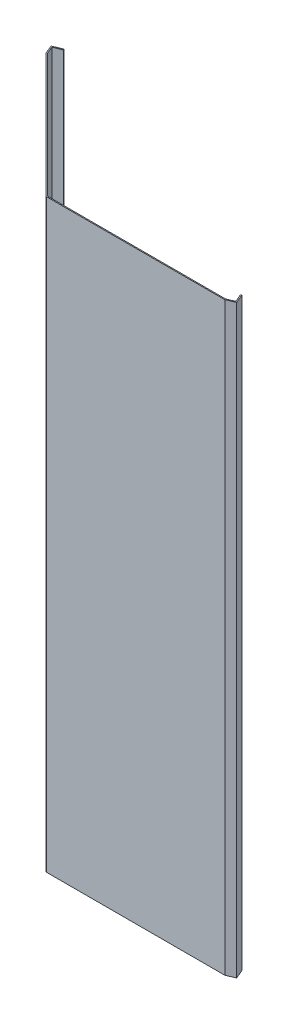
ISO-10303-21;
HEADER;
FILE_DESCRIPTION(('STEP AP214'),'2;1');
FILE_NAME('part.step','',(''),(''),'','','');
FILE_SCHEMA(('AUTOMOTIVE_DESIGN { 1 0 10303 214 1 1 1 1 }'));
ENDSEC;
DATA;
#1=APPLICATION_CONTEXT('core data for automotive mechanical design processes');
#2=APPLICATION_PROTOCOL_DEFINITION('international standard','automotive_design',2000,#1);
#3=PRODUCT_CONTEXT('',#1,'mechanical');
#4=PRODUCT('Part','Part','',(#3));
#5=PRODUCT_RELATED_PRODUCT_CATEGORY('part','',(#4));
#6=PRODUCT_DEFINITION_FORMATION('','',#4);
#7=PRODUCT_DEFINITION_CONTEXT('part definition',#1,'design');
#8=PRODUCT_DEFINITION('design','',#6,#7);
#9=PRODUCT_DEFINITION_SHAPE('','',#8);
#10=(LENGTH_UNIT() NAMED_UNIT(*) SI_UNIT(.MILLI.,.METRE.));
#11=(NAMED_UNIT(*) PLANE_ANGLE_UNIT() SI_UNIT($,.RADIAN.));
#12=(NAMED_UNIT(*) SI_UNIT($,.STERADIAN.) SOLID_ANGLE_UNIT());
#13=UNCERTAINTY_MEASURE_WITH_UNIT(LENGTH_MEASURE(1.E-05),#10,'distance_accuracy_value','');
#14=(GEOMETRIC_REPRESENTATION_CONTEXT(3) GLOBAL_UNCERTAINTY_ASSIGNED_CONTEXT((#13)) GLOBAL_UNIT_ASSIGNED_CONTEXT((#10,
#11,#12)) REPRESENTATION_CONTEXT('',''));
#15=CARTESIAN_POINT('',(0.,0.,0.));
#16=DIRECTION('',(0.,0.,1.));
#17=DIRECTION('',(1.,0.,0.));
#18=AXIS2_PLACEMENT_3D('',#15,#16,#17);
#19=CARTESIAN_POINT('',(-1155.74796303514,0.,-527.345895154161));
#20=DIRECTION('',(0.,-1.,0.));
#21=DIRECTION('',(-1.,0.,0.));
#22=AXIS2_PLACEMENT_3D('',#19,#20,#21);
#23=PLANE('',#22);
#24=DIRECTION('',(0.707106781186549,0.,-0.707106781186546));
#25=VECTOR('',#24,1.);
#26=CARTESIAN_POINT('',(-1022.47940818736,0.,-394.077340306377));
#27=LINE('',#26,#25);
#28=CARTESIAN_POINT('',(-1055.77837424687,0.,-360.778374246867));
#29=VERTEX_POINT('',#28);
#30=CARTESIAN_POINT('',(-1052.94994712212,0.,-363.606801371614));
#31=VERTEX_POINT('',#30);
#32=EDGE_CURVE('E554',#29,#31,#27,.T.);
#33=ORIENTED_EDGE('',*,*,#32,.F.);
#34=DIRECTION('',(-0.707106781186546,0.,-0.707106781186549));
#35=VECTOR('',#34,1.);
#36=CARTESIAN_POINT('',(-695.,0.,0.));
#37=LINE('',#36,#35);
#38=CARTESIAN_POINT('',(-1179.36814511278,0.,-484.368145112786));
#39=VERTEX_POINT('',#38);
#40=EDGE_CURVE('E466',#29,#39,#37,.T.);
#41=ORIENTED_EDGE('',*,*,#40,.T.);
#42=DIRECTION('',(-0.37460659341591,0.,-0.927183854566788));
#43=VECTOR('',#42,1.);
#44=CARTESIAN_POINT('',(-1179.36814511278,0.,-484.368145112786));
#45=LINE('',#44,#43);
#46=CARTESIAN_POINT('',(-1192.47937588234,0.,-516.819580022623));
#47=VERTEX_POINT('',#46);
#48=EDGE_CURVE('E463',#39,#47,#45,.T.);
#49=ORIENTED_EDGE('',*,*,#48,.T.);
#50=DIRECTION('',(0.927183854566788,0.,-0.37460659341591));
#51=VECTOR('',#50,1.);
#52=CARTESIAN_POINT('',(-1192.47937588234,0.,-516.819580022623));
#53=LINE('',#52,#51);
#54=CARTESIAN_POINT('',(-1157.2463894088,0.,-531.054630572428));
#55=VERTEX_POINT('',#54);
#56=EDGE_CURVE('E460',#47,#55,#53,.T.);
#57=ORIENTED_EDGE('',*,*,#56,.T.);
#58=DIRECTION('',(0.374606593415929,0.,0.927183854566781));
#59=VECTOR('',#58,1.);
#60=CARTESIAN_POINT('',(-1157.2463894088,0.,-531.054630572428));
#61=LINE('',#60,#59);
#62=CARTESIAN_POINT('',(-1155.74796303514,0.,-527.345895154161));
#63=VERTEX_POINT('',#62);
#64=EDGE_CURVE('E457',#55,#63,#61,.T.);
#65=ORIENTED_EDGE('',*,*,#64,.T.);
#66=DIRECTION('',(0.927183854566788,0.,-0.37460659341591));
#67=VECTOR('',#66,1.);
#68=CARTESIAN_POINT('',(-1190.98094950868,0.,-513.110844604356));
#69=LINE('',#68,#67);
#70=CARTESIAN_POINT('',(-1187.27221409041,0.,-514.60927097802));
#71=VERTEX_POINT('',#70);
#72=EDGE_CURVE('E410',#71,#63,#69,.T.);
#73=ORIENTED_EDGE('',*,*,#72,.F.);
#74=DIRECTION('',(-0.37460659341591,0.,-0.927183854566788));
#75=VECTOR('',#74,1.);
#76=CARTESIAN_POINT('',(-1175.65940969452,0.,-485.866571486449));
#77=LINE('',#76,#75);
#78=CARTESIAN_POINT('',(-1175.96426798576,0.,-486.62112223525));
#79=VERTEX_POINT('',#78);
#80=EDGE_CURVE('E420',#79,#71,#77,.T.);
#81=ORIENTED_EDGE('',*,*,#80,.F.);
#82=DIRECTION('',(-0.707106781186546,0.,-0.707106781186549));
#83=VECTOR('',#82,1.);
#84=CARTESIAN_POINT('',(-692.171572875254,0.,-2.8284271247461));
#85=LINE('',#84,#83);
#86=EDGE_CURVE('E489',#31,#79,#85,.T.);
#87=ORIENTED_EDGE('',*,*,#86,.F.);
#88=EDGE_LOOP('',(#33,#41,#49,#57,#65,#73,#81,#87));
#89=FACE_BOUND('',#88,.T.);
#90=ADVANCED_FACE('F33',(#89),#23,.T.);
#91=CARTESIAN_POINT('',(-1190.98094950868,2276.,-513.110844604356));
#92=DIRECTION('',(-0.37460659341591,0.,-0.927183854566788));
#93=DIRECTION('',(-0.927183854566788,0.,0.37460659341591));
#94=AXIS2_PLACEMENT_3D('',#91,#92,#93);
#95=PLANE('',#94);
#96=ORIENTED_EDGE('',*,*,#72,.T.);
#97=DIRECTION('',(0.,-1.,0.));
#98=VECTOR('',#97,1.);
#99=CARTESIAN_POINT('',(-1155.74796303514,2276.,-527.345895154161));
#100=LINE('',#99,#98);
#101=CARTESIAN_POINT('',(-1155.74796303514,2276.,-527.345895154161));
#102=VERTEX_POINT('',#101);
#103=EDGE_CURVE('E520',#102,#63,#100,.T.);
#104=ORIENTED_EDGE('',*,*,#103,.F.);
#105=DIRECTION('',(0.927183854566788,0.,-0.37460659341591));
#106=VECTOR('',#105,1.);
#107=CARTESIAN_POINT('',(-1190.98094950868,2276.,-513.110844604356));
#108=LINE('',#107,#106);
#109=CARTESIAN_POINT('',(-1187.27221409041,2276.,-514.60927097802));
#110=VERTEX_POINT('',#109);
#111=EDGE_CURVE('E417',#110,#102,#108,.T.);
#112=ORIENTED_EDGE('',*,*,#111,.F.);
#113=DIRECTION('',(0.,-1.,0.));
#114=VECTOR('',#113,1.);
#115=CARTESIAN_POINT('',(-1187.27221409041,2276.,-514.60927097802));
#116=LINE('',#115,#114);
#117=EDGE_CURVE('E454',#110,#71,#116,.T.);
#118=ORIENTED_EDGE('',*,*,#117,.T.);
#119=EDGE_LOOP('',(#96,#104,#112,#118));
#120=FACE_BOUND('',#119,.T.);
#121=ADVANCED_FACE('F619',(#120),#95,.F.);
#122=CARTESIAN_POINT('',(-1157.2463894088,2276.,-531.054630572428));
#123=DIRECTION('',(0.927183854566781,0.,-0.374606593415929));
#124=DIRECTION('',(-0.374606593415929,0.,-0.927183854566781));
#125=AXIS2_PLACEMENT_3D('',#122,#123,#124);
#126=PLANE('',#125);
#127=ORIENTED_EDGE('',*,*,#64,.F.);
#128=DIRECTION('',(0.,-1.,0.));
#129=VECTOR('',#128,1.);
#130=CARTESIAN_POINT('',(-1157.2463894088,2276.,-531.054630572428));
#131=LINE('',#130,#129);
#132=CARTESIAN_POINT('',(-1157.2463894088,2276.,-531.054630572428));
#133=VERTEX_POINT('',#132);
#134=EDGE_CURVE('E518',#133,#55,#131,.T.);
#135=ORIENTED_EDGE('',*,*,#134,.F.);
#136=DIRECTION('',(0.374606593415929,0.,0.927183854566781));
#137=VECTOR('',#136,1.);
#138=CARTESIAN_POINT('',(-1157.2463894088,2276.,-531.054630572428));
#139=LINE('',#138,#137);
#140=EDGE_CURVE('E419',#133,#102,#139,.T.);
#141=ORIENTED_EDGE('',*,*,#140,.T.);
#142=ORIENTED_EDGE('',*,*,#103,.T.);
#143=EDGE_LOOP('',(#127,#135,#141,#142));
#144=FACE_BOUND('',#143,.T.);
#145=ADVANCED_FACE('F626',(#144),#126,.T.);
#146=CARTESIAN_POINT('',(-1192.47937588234,2276.,-516.819580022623));
#147=DIRECTION('',(-0.37460659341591,0.,-0.927183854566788));
#148=DIRECTION('',(-0.927183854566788,0.,0.37460659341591));
#149=AXIS2_PLACEMENT_3D('',#146,#147,#148);
#150=PLANE('',#149);
#151=ORIENTED_EDGE('',*,*,#56,.F.);
#152=DIRECTION('',(0.,-1.,0.));
#153=VECTOR('',#152,1.);
#154=CARTESIAN_POINT('',(-1192.47937588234,2276.,-516.819580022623));
#155=LINE('',#154,#153);
#156=CARTESIAN_POINT('',(-1192.47937588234,2276.,-516.819580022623));
#157=VERTEX_POINT('',#156);
#158=EDGE_CURVE('E516',#157,#47,#155,.T.);
#159=ORIENTED_EDGE('',*,*,#158,.F.);
#160=DIRECTION('',(0.927183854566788,0.,-0.37460659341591));
#161=VECTOR('',#160,1.);
#162=CARTESIAN_POINT('',(-1192.47937588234,2276.,-516.819580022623));
#163=LINE('',#162,#161);
#164=EDGE_CURVE('E423',#157,#133,#163,.T.);
#165=ORIENTED_EDGE('',*,*,#164,.T.);
#166=ORIENTED_EDGE('',*,*,#134,.T.);
#167=EDGE_LOOP('',(#151,#159,#165,#166));
#168=FACE_BOUND('',#167,.T.);
#169=ADVANCED_FACE('F731',(#168),#150,.T.);
#170=CARTESIAN_POINT('',(-1179.36814511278,2276.,-484.368145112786));
#171=DIRECTION('',(-0.927183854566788,0.,0.37460659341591));
#172=DIRECTION('',(0.37460659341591,0.,0.927183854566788));
#173=AXIS2_PLACEMENT_3D('',#170,#171,#172);
#174=PLANE('',#173);
#175=ORIENTED_EDGE('',*,*,#48,.F.);
#176=DIRECTION('',(0.,-1.,0.));
#177=VECTOR('',#176,1.);
#178=CARTESIAN_POINT('',(-1179.36814511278,2276.,-484.368145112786));
#179=LINE('',#178,#177);
#180=CARTESIAN_POINT('',(-1179.36814511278,2276.,-484.368145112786));
#181=VERTEX_POINT('',#180);
#182=EDGE_CURVE('E513',#181,#39,#179,.T.);
#183=ORIENTED_EDGE('',*,*,#182,.F.);
#184=DIRECTION('',(-0.37460659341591,0.,-0.927183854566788));
#185=VECTOR('',#184,1.);
#186=CARTESIAN_POINT('',(-1179.36814511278,2276.,-484.368145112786));
#187=LINE('',#186,#185);
#188=EDGE_CURVE('E426',#181,#157,#187,.T.);
#189=ORIENTED_EDGE('',*,*,#188,.T.);
#190=ORIENTED_EDGE('',*,*,#158,.T.);
#191=EDGE_LOOP('',(#175,#183,#189,#190));
#192=FACE_BOUND('',#191,.T.);
#193=ADVANCED_FACE('F728',(#192),#174,.T.);
#194=CARTESIAN_POINT('',(-695.,2276.,0.));
#195=DIRECTION('',(-0.707106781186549,0.,0.707106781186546));
#196=DIRECTION('',(0.707106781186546,0.,0.707106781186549));
#197=AXIS2_PLACEMENT_3D('',#194,#195,#196);
#198=PLANE('',#197);
#199=DIRECTION('',(0.,-1.,0.));
#200=VECTOR('',#199,1.);
#201=CARTESIAN_POINT('',(-1098.20478111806,1800.,-403.204781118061));
#202=LINE('',#201,#200);
#203=CARTESIAN_POINT('',(-1098.20478111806,1800.,-403.204781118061));
#204=VERTEX_POINT('',#203);
#205=CARTESIAN_POINT('',(-1098.20478111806,1740.,-403.204781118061));
#206=VERTEX_POINT('',#205);
#207=EDGE_CURVE('E48',#204,#206,#202,.T.);
#208=ORIENTED_EDGE('',*,*,#207,.F.);
#209=DIRECTION('',(-0.707106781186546,0.,-0.707106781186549));
#210=VECTOR('',#209,1.);
#211=CARTESIAN_POINT('',(-1098.20478111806,1800.,-403.204781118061));
#212=LINE('',#211,#210);
#213=CARTESIAN_POINT('',(-780.006729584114,1800.,-85.0067295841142));
#214=VERTEX_POINT('',#213);
#215=EDGE_CURVE('E309',#214,#204,#212,.T.);
#216=ORIENTED_EDGE('',*,*,#215,.F.);
#217=DIRECTION('',(0.,1.,0.));
#218=VECTOR('',#217,1.);
#219=CARTESIAN_POINT('',(-780.006729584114,1800.,-85.0067295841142));
#220=LINE('',#219,#218);
#221=CARTESIAN_POINT('',(-780.006729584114,1740.,-85.0067295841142));
#222=VERTEX_POINT('',#221);
#223=EDGE_CURVE('E293',#222,#214,#220,.T.);
#224=ORIENTED_EDGE('',*,*,#223,.F.);
#225=DIRECTION('',(0.707106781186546,0.,0.707106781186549));
#226=VECTOR('',#225,1.);
#227=CARTESIAN_POINT('',(-1098.20478111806,1740.,-403.204781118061));
#228=LINE('',#227,#226);
#229=EDGE_CURVE('E302',#206,#222,#228,.T.);
#230=ORIENTED_EDGE('',*,*,#229,.F.);
#231=EDGE_LOOP('',(#208,#216,#224,#230));
#232=FACE_BOUND('',#231,.T.);
#233=DIRECTION('',(0.,-1.,0.));
#234=VECTOR('',#233,1.);
#235=CARTESIAN_POINT('',(-1098.20478111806,1720.,-403.204781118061));
#236=LINE('',#235,#234);
#237=CARTESIAN_POINT('',(-1098.20478111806,1720.,-403.204781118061));
#238=VERTEX_POINT('',#237);
#239=CARTESIAN_POINT('',(-1098.20478111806,1660.,-403.204781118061));
#240=VERTEX_POINT('',#239);
#241=EDGE_CURVE('E316',#238,#240,#236,.T.);
#242=ORIENTED_EDGE('',*,*,#241,.F.);
#243=DIRECTION('',(-0.707106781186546,0.,-0.707106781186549));
#244=VECTOR('',#243,1.);
#245=CARTESIAN_POINT('',(-1098.20478111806,1720.,-403.204781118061));
#246=LINE('',#245,#244);
#247=CARTESIAN_POINT('',(-780.006729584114,1720.,-85.006729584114));
#248=VERTEX_POINT('',#247);
#249=EDGE_CURVE('E326',#248,#238,#246,.T.);
#250=ORIENTED_EDGE('',*,*,#249,.F.);
#251=DIRECTION('',(0.,1.,0.));
#252=VECTOR('',#251,1.);
#253=CARTESIAN_POINT('',(-780.006729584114,1720.,-85.006729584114));
#254=LINE('',#253,#252);
#255=CARTESIAN_POINT('',(-780.006729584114,1660.,-85.006729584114));
#256=VERTEX_POINT('',#255);
#257=EDGE_CURVE('E323',#256,#248,#254,.T.);
#258=ORIENTED_EDGE('',*,*,#257,.F.);
#259=DIRECTION('',(0.707106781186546,0.,0.707106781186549));
#260=VECTOR('',#259,1.);
#261=CARTESIAN_POINT('',(-1098.20478111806,1660.,-403.204781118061));
#262=LINE('',#261,#260);
#263=EDGE_CURVE('E320',#240,#256,#262,.T.);
#264=ORIENTED_EDGE('',*,*,#263,.F.);
#265=EDGE_LOOP('',(#242,#250,#258,#264));
#266=FACE_BOUND('',#265,.T.);
#267=DIRECTION('',(0.,-1.,0.));
#268=VECTOR('',#267,1.);
#269=CARTESIAN_POINT('',(-1098.20478111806,1640.,-403.204781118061));
#270=LINE('',#269,#268);
#271=CARTESIAN_POINT('',(-1098.20478111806,1640.,-403.204781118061));
#272=VERTEX_POINT('',#271);
#273=CARTESIAN_POINT('',(-1098.20478111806,1580.,-403.204781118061));
#274=VERTEX_POINT('',#273);
#275=EDGE_CURVE('E332',#272,#274,#270,.T.);
#276=ORIENTED_EDGE('',*,*,#275,.F.);
#277=DIRECTION('',(-0.707106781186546,0.,-0.707106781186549));
#278=VECTOR('',#277,1.);
#279=CARTESIAN_POINT('',(-1098.20478111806,1640.,-403.204781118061));
#280=LINE('',#279,#278);
#281=CARTESIAN_POINT('',(-780.006729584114,1640.,-85.0067295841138));
#282=VERTEX_POINT('',#281);
#283=EDGE_CURVE('E346',#282,#272,#280,.T.);
#284=ORIENTED_EDGE('',*,*,#283,.F.);
#285=DIRECTION('',(0.,1.,0.));
#286=VECTOR('',#285,1.);
#287=CARTESIAN_POINT('',(-780.006729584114,1640.,-85.0067295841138));
#288=LINE('',#287,#286);
#289=CARTESIAN_POINT('',(-780.006729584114,1580.,-85.0067295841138));
#290=VERTEX_POINT('',#289);
#291=EDGE_CURVE('E343',#290,#282,#288,.T.);
#292=ORIENTED_EDGE('',*,*,#291,.F.);
#293=DIRECTION('',(0.707106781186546,0.,0.707106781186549));
#294=VECTOR('',#293,1.);
#295=CARTESIAN_POINT('',(-1098.20478111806,1580.,-403.204781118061));
#296=LINE('',#295,#294);
#297=EDGE_CURVE('E340',#274,#290,#296,.T.);
#298=ORIENTED_EDGE('',*,*,#297,.F.);
#299=EDGE_LOOP('',(#276,#284,#292,#298));
#300=FACE_BOUND('',#299,.T.);
#301=DIRECTION('',(0.,-1.,0.));
#302=VECTOR('',#301,1.);
#303=CARTESIAN_POINT('',(-1098.20478111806,1560.,-403.20478111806));
#304=LINE('',#303,#302);
#305=CARTESIAN_POINT('',(-1098.20478111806,1560.,-403.20478111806));
#306=VERTEX_POINT('',#305);
#307=CARTESIAN_POINT('',(-1098.20478111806,1500.,-403.20478111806));
#308=VERTEX_POINT('',#307);
#309=EDGE_CURVE('E352',#306,#308,#304,.T.);
#310=ORIENTED_EDGE('',*,*,#309,.F.);
#311=DIRECTION('',(-0.707106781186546,0.,-0.707106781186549));
#312=VECTOR('',#311,1.);
#313=CARTESIAN_POINT('',(-1098.20478111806,1560.,-403.20478111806));
#314=LINE('',#313,#312);
#315=CARTESIAN_POINT('',(-780.006729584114,1560.,-85.0067295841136));
#316=VERTEX_POINT('',#315);
#317=EDGE_CURVE('E366',#316,#306,#314,.T.);
#318=ORIENTED_EDGE('',*,*,#317,.F.);
#319=DIRECTION('',(0.,1.,0.));
#320=VECTOR('',#319,1.);
#321=CARTESIAN_POINT('',(-780.006729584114,1560.,-85.0067295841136));
#322=LINE('',#321,#320);
#323=CARTESIAN_POINT('',(-780.006729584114,1500.,-85.0067295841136));
#324=VERTEX_POINT('',#323);
#325=EDGE_CURVE('E363',#324,#316,#322,.T.);
#326=ORIENTED_EDGE('',*,*,#325,.F.);
#327=DIRECTION('',(0.707106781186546,0.,0.707106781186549));
#328=VECTOR('',#327,1.);
#329=CARTESIAN_POINT('',(-1098.20478111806,1500.,-403.20478111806));
#330=LINE('',#329,#328);
#331=EDGE_CURVE('E360',#308,#324,#330,.T.);
#332=ORIENTED_EDGE('',*,*,#331,.F.);
#333=EDGE_LOOP('',(#310,#318,#326,#332));
#334=FACE_BOUND('',#333,.T.);
#335=DIRECTION('',(0.,-1.,0.));
#336=VECTOR('',#335,1.);
#337=CARTESIAN_POINT('',(-1055.77837424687,665.,-360.778374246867));
#338=LINE('',#337,#336);
#339=CARTESIAN_POINT('',(-1055.77837424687,665.,-360.778374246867));
#340=VERTEX_POINT('',#339);
#341=EDGE_CURVE('E372',#340,#29,#338,.T.);
#342=ORIENTED_EDGE('',*,*,#341,.F.);
#343=DIRECTION('',(-0.707106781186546,0.,-0.707106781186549));
#344=VECTOR('',#343,1.);
#345=CARTESIAN_POINT('',(-1055.77837424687,665.,-360.778374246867));
#346=LINE('',#345,#344);
#347=CARTESIAN_POINT('',(-751.722458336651,665.,-56.7224583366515));
#348=VERTEX_POINT('',#347);
#349=EDGE_CURVE('E383',#348,#340,#346,.T.);
#350=ORIENTED_EDGE('',*,*,#349,.F.);
#351=DIRECTION('',(0.,1.,0.));
#352=VECTOR('',#351,1.);
#353=CARTESIAN_POINT('',(-751.722458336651,665.,-56.7224583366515));
#354=LINE('',#353,#352);
#355=CARTESIAN_POINT('',(-751.722458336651,0.,-56.7224583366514));
#356=VERTEX_POINT('',#355);
#357=EDGE_CURVE('E380',#356,#348,#354,.T.);
#358=ORIENTED_EDGE('',*,*,#357,.F.);
#359=CARTESIAN_POINT('',(-696.171572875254,0.,-1.17157287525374));
#360=VERTEX_POINT('',#359);
#361=EDGE_CURVE('E467',#360,#356,#37,.T.);
#362=ORIENTED_EDGE('',*,*,#361,.F.);
#363=DIRECTION('',(0.,-1.,0.));
#364=VECTOR('',#363,1.);
#365=CARTESIAN_POINT('',(-696.171572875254,2276.,-1.17157287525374));
#366=LINE('',#365,#364);
#367=CARTESIAN_POINT('',(-696.171572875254,2276.,-1.17157287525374));
#368=VERTEX_POINT('',#367);
#369=EDGE_CURVE('E527',#360,#368,#366,.F.);
#370=ORIENTED_EDGE('',*,*,#369,.T.);
#371=DIRECTION('',(-0.707106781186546,0.,-0.707106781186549));
#372=VECTOR('',#371,1.);
#373=CARTESIAN_POINT('',(-695.,2276.,0.));
#374=LINE('',#373,#372);
#375=EDGE_CURVE('E429',#368,#181,#374,.T.);
#376=ORIENTED_EDGE('',*,*,#375,.T.);
#377=ORIENTED_EDGE('',*,*,#182,.T.);
#378=ORIENTED_EDGE('',*,*,#40,.F.);
#379=EDGE_LOOP('',(#342,#350,#358,#362,#370,#376,#377,#378));
#380=FACE_BOUND('',#379,.T.);
#381=DIRECTION('',(0.,-1.,0.));
#382=VECTOR('',#381,1.);
#383=CARTESIAN_POINT('',(-1098.20478111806,1480.,-403.20478111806));
#384=LINE('',#383,#382);
#385=CARTESIAN_POINT('',(-1098.20478111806,1480.,-403.20478111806));
#386=VERTEX_POINT('',#385);
#387=CARTESIAN_POINT('',(-1098.20478111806,1420.,-403.20478111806));
#388=VERTEX_POINT('',#387);
#389=EDGE_CURVE('E396',#386,#388,#384,.T.);
#390=ORIENTED_EDGE('',*,*,#389,.F.);
#391=DIRECTION('',(-0.707106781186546,0.,-0.707106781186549));
#392=VECTOR('',#391,1.);
#393=CARTESIAN_POINT('',(-1098.20478111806,1480.,-403.20478111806));
#394=LINE('',#393,#392);
#395=CARTESIAN_POINT('',(-780.006729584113,1480.,-85.0067295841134));
#396=VERTEX_POINT('',#395);
#397=EDGE_CURVE('E404',#396,#386,#394,.T.);
#398=ORIENTED_EDGE('',*,*,#397,.F.);
#399=DIRECTION('',(0.,1.,0.));
#400=VECTOR('',#399,1.);
#401=CARTESIAN_POINT('',(-780.006729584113,1480.,-85.0067295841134));
#402=LINE('',#401,#400);
#403=CARTESIAN_POINT('',(-780.006729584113,1420.,-85.0067295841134));
#404=VERTEX_POINT('',#403);
#405=EDGE_CURVE('E401',#404,#396,#402,.T.);
#406=ORIENTED_EDGE('',*,*,#405,.F.);
#407=DIRECTION('',(0.707106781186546,0.,0.707106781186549));
#408=VECTOR('',#407,1.);
#409=CARTESIAN_POINT('',(-1098.20478111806,1420.,-403.20478111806));
#410=LINE('',#409,#408);
#411=EDGE_CURVE('E398',#388,#404,#410,.T.);
#412=ORIENTED_EDGE('',*,*,#411,.F.);
#413=EDGE_LOOP('',(#390,#398,#406,#412));
#414=FACE_BOUND('',#413,.T.);
#415=ADVANCED_FACE('F306',(#232,#266,#300,#334,#380,#414),#198,.T.);
#416=CARTESIAN_POINT('',(0.,2276.,0.));
#417=DIRECTION('',(0.,0.,1.));
#418=DIRECTION('',(1.,0.,0.));
#419=AXIS2_PLACEMENT_3D('',#416,#417,#418);
#420=PLANE('',#419);
#421=DIRECTION('',(-1.,0.,0.));
#422=VECTOR('',#421,1.);
#423=CARTESIAN_POINT('',(0.,2276.,0.));
#424=LINE('',#423,#422);
#425=CARTESIAN_POINT('',(0.,2276.,0.));
#426=VERTEX_POINT('',#425);
#427=CARTESIAN_POINT('',(-693.343145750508,2276.,0.));
#428=VERTEX_POINT('',#427);
#429=EDGE_CURVE('E431',#426,#428,#424,.T.);
#430=ORIENTED_EDGE('',*,*,#429,.T.);
#431=DIRECTION('',(0.,-1.,0.));
#432=VECTOR('',#431,1.);
#433=CARTESIAN_POINT('',(-693.343145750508,2276.,0.));
#434=LINE('',#433,#432);
#435=CARTESIAN_POINT('',(-693.343145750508,0.,0.));
#436=VERTEX_POINT('',#435);
#437=EDGE_CURVE('E522',#428,#436,#434,.T.);
#438=ORIENTED_EDGE('',*,*,#437,.T.);
#439=DIRECTION('',(-1.,0.,0.));
#440=VECTOR('',#439,1.);
#441=CARTESIAN_POINT('',(0.,0.,0.));
#442=LINE('',#441,#440);
#443=CARTESIAN_POINT('',(0.,0.,0.));
#444=VERTEX_POINT('',#443);
#445=EDGE_CURVE('E470',#444,#436,#442,.T.);
#446=ORIENTED_EDGE('',*,*,#445,.F.);
#447=DIRECTION('',(0.,-1.,0.));
#448=VECTOR('',#447,1.);
#449=CARTESIAN_POINT('',(0.,2276.,0.));
#450=LINE('',#449,#448);
#451=EDGE_CURVE('E511',#426,#444,#450,.T.);
#452=ORIENTED_EDGE('',*,*,#451,.F.);
#453=EDGE_LOOP('',(#430,#438,#446,#452));
#454=FACE_BOUND('',#453,.T.);
#455=ADVANCED_FACE('F683',(#454),#420,.T.);
#456=CARTESIAN_POINT('',(0.,2276.,0.));
#457=DIRECTION('',(0.390731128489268,0.,0.920504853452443));
#458=DIRECTION('',(0.920504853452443,0.,-0.390731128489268));
#459=AXIS2_PLACEMENT_3D('',#456,#457,#458);
#460=PLANE('',#459);
#461=DIRECTION('',(-0.920504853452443,0.,0.390731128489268));
#462=VECTOR('',#461,1.);
#463=CARTESIAN_POINT('',(0.,0.,0.));
#464=LINE('',#463,#462);
#465=CARTESIAN_POINT('',(32.2176698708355,0.,-13.6755894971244));
#466=VERTEX_POINT('',#465);
#467=EDGE_CURVE('E473',#466,#444,#464,.T.);
#468=ORIENTED_EDGE('',*,*,#467,.F.);
#469=DIRECTION('',(0.,-1.,0.));
#470=VECTOR('',#469,1.);
#471=CARTESIAN_POINT('',(32.2176698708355,2276.,-13.6755894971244));
#472=LINE('',#471,#470);
#473=CARTESIAN_POINT('',(32.2176698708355,2276.,-13.6755894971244));
#474=VERTEX_POINT('',#473);
#475=EDGE_CURVE('E509',#474,#466,#472,.T.);
#476=ORIENTED_EDGE('',*,*,#475,.F.);
#477=DIRECTION('',(-0.920504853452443,0.,0.390731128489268));
#478=VECTOR('',#477,1.);
#479=CARTESIAN_POINT('',(0.,2276.,0.));
#480=LINE('',#479,#478);
#481=EDGE_CURVE('E434',#474,#426,#480,.T.);
#482=ORIENTED_EDGE('',*,*,#481,.T.);
#483=ORIENTED_EDGE('',*,*,#451,.T.);
#484=EDGE_LOOP('',(#468,#476,#482,#483));
#485=FACE_BOUND('',#484,.T.);
#486=ADVANCED_FACE('F679',(#485),#460,.T.);
#487=CARTESIAN_POINT('',(32.2176698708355,2276.,-13.6755894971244));
#488=DIRECTION('',(0.920504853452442,0.,-0.390731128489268));
#489=DIRECTION('',(-0.390731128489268,0.,-0.920504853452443));
#490=AXIS2_PLACEMENT_3D('',#487,#488,#489);
#491=PLANE('',#490);
#492=DIRECTION('',(0.390731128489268,0.,0.920504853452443));
#493=VECTOR('',#492,1.);
#494=CARTESIAN_POINT('',(32.2176698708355,0.,-13.6755894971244));
#495=LINE('',#494,#493);
#496=CARTESIAN_POINT('',(17.3698869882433,0.,-48.6547739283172));
#497=VERTEX_POINT('',#496);
#498=EDGE_CURVE('E476',#497,#466,#495,.T.);
#499=ORIENTED_EDGE('',*,*,#498,.F.);
#500=DIRECTION('',(0.,-1.,0.));
#501=VECTOR('',#500,1.);
#502=CARTESIAN_POINT('',(17.3698869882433,2276.,-48.6547739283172));
#503=LINE('',#502,#501);
#504=CARTESIAN_POINT('',(17.3698869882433,2276.,-48.6547739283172));
#505=VERTEX_POINT('',#504);
#506=EDGE_CURVE('E507',#505,#497,#503,.T.);
#507=ORIENTED_EDGE('',*,*,#506,.F.);
#508=DIRECTION('',(0.390731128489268,0.,0.920504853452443));
#509=VECTOR('',#508,1.);
#510=CARTESIAN_POINT('',(32.2176698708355,2276.,-13.6755894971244));
#511=LINE('',#510,#509);
#512=EDGE_CURVE('E437',#505,#474,#511,.T.);
#513=ORIENTED_EDGE('',*,*,#512,.T.);
#514=ORIENTED_EDGE('',*,*,#475,.T.);
#515=EDGE_LOOP('',(#499,#507,#513,#514));
#516=FACE_BOUND('',#515,.T.);
#517=ADVANCED_FACE('F675',(#516),#491,.T.);
#518=CARTESIAN_POINT('',(13.6878675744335,2276.,-47.0918494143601));
#519=DIRECTION('',(-0.390731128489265,0.,-0.920504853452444));
#520=DIRECTION('',(-0.920504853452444,0.,0.390731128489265));
#521=AXIS2_PLACEMENT_3D('',#518,#519,#520);
#522=PLANE('',#521);
#523=DIRECTION('',(0.920504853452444,0.,-0.390731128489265));
#524=VECTOR('',#523,1.);
#525=CARTESIAN_POINT('',(13.6878675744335,0.,-47.0918494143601));
#526=LINE('',#525,#524);
#527=CARTESIAN_POINT('',(13.6878675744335,0.,-47.0918494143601));
#528=VERTEX_POINT('',#527);
#529=EDGE_CURVE('E479',#528,#497,#526,.T.);
#530=ORIENTED_EDGE('',*,*,#529,.F.);
#531=DIRECTION('',(0.,-1.,0.));
#532=VECTOR('',#531,1.);
#533=CARTESIAN_POINT('',(13.6878675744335,2276.,-47.0918494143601));
#534=LINE('',#533,#532);
#535=CARTESIAN_POINT('',(13.6878675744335,2276.,-47.0918494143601));
#536=VERTEX_POINT('',#535);
#537=EDGE_CURVE('E505',#536,#528,#534,.T.);
#538=ORIENTED_EDGE('',*,*,#537,.F.);
#539=DIRECTION('',(0.920504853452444,0.,-0.390731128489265));
#540=VECTOR('',#539,1.);
#541=CARTESIAN_POINT('',(13.6878675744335,2276.,-47.0918494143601));
#542=LINE('',#541,#540);
#543=EDGE_CURVE('E440',#536,#505,#542,.T.);
#544=ORIENTED_EDGE('',*,*,#543,.T.);
#545=ORIENTED_EDGE('',*,*,#506,.T.);
#546=EDGE_LOOP('',(#530,#538,#544,#545));
#547=FACE_BOUND('',#546,.T.);
#548=ADVANCED_FACE('F669',(#547),#522,.T.);
#549=CARTESIAN_POINT('',(28.5356504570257,2276.,-12.1126649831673));
#550=DIRECTION('',(0.920504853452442,0.,-0.390731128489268));
#551=DIRECTION('',(-0.390731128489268,0.,-0.920504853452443));
#552=AXIS2_PLACEMENT_3D('',#549,#550,#551);
#553=PLANE('',#552);
#554=DIRECTION('',(0.390731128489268,0.,0.920504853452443));
#555=VECTOR('',#554,1.);
#556=CARTESIAN_POINT('',(28.5356504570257,0.,-12.1126649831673));
#557=LINE('',#556,#555);
#558=CARTESIAN_POINT('',(26.9727259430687,0.,-15.7946843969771));
#559=VERTEX_POINT('',#558);
#560=EDGE_CURVE('E482',#528,#559,#557,.T.);
#561=ORIENTED_EDGE('',*,*,#560,.T.);
#562=DIRECTION('',(0.,-1.,0.));
#563=VECTOR('',#562,1.);
#564=CARTESIAN_POINT('',(26.9727259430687,2276.,-15.7946843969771));
#565=LINE('',#564,#563);
#566=CARTESIAN_POINT('',(26.9727259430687,2276.,-15.7946843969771));
#567=VERTEX_POINT('',#566);
#568=EDGE_CURVE('E502',#567,#559,#565,.T.);
#569=ORIENTED_EDGE('',*,*,#568,.F.);
#570=DIRECTION('',(0.390731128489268,0.,0.920504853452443));
#571=VECTOR('',#570,1.);
#572=CARTESIAN_POINT('',(28.5356504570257,2276.,-12.1126649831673));
#573=LINE('',#572,#571);
#574=EDGE_CURVE('E443',#536,#567,#573,.T.);
#575=ORIENTED_EDGE('',*,*,#574,.F.);
#576=ORIENTED_EDGE('',*,*,#537,.T.);
#577=EDGE_LOOP('',(#561,#569,#575,#576));
#578=FACE_BOUND('',#577,.T.);
#579=ADVANCED_FACE('F709',(#578),#553,.F.);
#580=CARTESIAN_POINT('',(-1.56292451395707,2276.,-3.68201941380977));
#581=DIRECTION('',(0.390731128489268,0.,0.920504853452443));
#582=DIRECTION('',(0.920504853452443,0.,-0.390731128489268));
#583=AXIS2_PLACEMENT_3D('',#580,#581,#582);
#584=PLANE('',#583);
#585=DIRECTION('',(-0.920504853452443,0.,0.390731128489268));
#586=VECTOR('',#585,1.);
#587=CARTESIAN_POINT('',(-1.56292451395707,0.,-3.68201941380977));
#588=LINE('',#587,#586);
#589=CARTESIAN_POINT('',(-0.813809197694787,0.,-4.));
#590=VERTEX_POINT('',#589);
#591=EDGE_CURVE('E484',#559,#590,#588,.T.);
#592=ORIENTED_EDGE('',*,*,#591,.T.);
#593=DIRECTION('',(0.,-1.,0.));
#594=VECTOR('',#593,1.);
#595=CARTESIAN_POINT('',(-0.813809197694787,2276.,-4.));
#596=LINE('',#595,#594);
#597=CARTESIAN_POINT('',(-0.813809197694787,2276.,-4.));
#598=VERTEX_POINT('',#597);
#599=EDGE_CURVE('E499',#598,#590,#596,.T.);
#600=ORIENTED_EDGE('',*,*,#599,.F.);
#601=DIRECTION('',(-0.920504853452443,0.,0.390731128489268));
#602=VECTOR('',#601,1.);
#603=CARTESIAN_POINT('',(-1.56292451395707,2276.,-3.68201941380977));
#604=LINE('',#603,#602);
#605=EDGE_CURVE('E445',#567,#598,#604,.T.);
#606=ORIENTED_EDGE('',*,*,#605,.F.);
#607=ORIENTED_EDGE('',*,*,#568,.T.);
#608=EDGE_LOOP('',(#592,#600,#606,#607));
#609=FACE_BOUND('',#608,.T.);
#610=ADVANCED_FACE('F663',(#609),#584,.F.);
#611=CARTESIAN_POINT('',(0.,2276.,-4.));
#612=DIRECTION('',(0.,0.,1.));
#613=DIRECTION('',(1.,0.,0.));
#614=AXIS2_PLACEMENT_3D('',#611,#612,#613);
#615=PLANE('',#614);
#616=DIRECTION('',(-1.,0.,0.));
#617=VECTOR('',#616,1.);
#618=CARTESIAN_POINT('',(0.,0.,-4.));
#619=LINE('',#618,#617);
#620=CARTESIAN_POINT('',(-692.514718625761,0.,-3.99999999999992));
#621=VERTEX_POINT('',#620);
#622=EDGE_CURVE('E486',#590,#621,#619,.T.);
#623=ORIENTED_EDGE('',*,*,#622,.T.);
#624=DIRECTION('',(0.,-1.,0.));
#625=VECTOR('',#624,1.);
#626=CARTESIAN_POINT('',(-692.514718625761,2276.,-3.99999999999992));
#627=LINE('',#626,#625);
#628=CARTESIAN_POINT('',(-692.514718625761,2276.,-3.99999999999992));
#629=VERTEX_POINT('',#628);
#630=EDGE_CURVE('E534',#621,#629,#627,.F.);
#631=ORIENTED_EDGE('',*,*,#630,.T.);
#632=DIRECTION('',(-1.,0.,0.));
#633=VECTOR('',#632,1.);
#634=CARTESIAN_POINT('',(0.,2276.,-4.));
#635=LINE('',#634,#633);
#636=EDGE_CURVE('E447',#598,#629,#635,.T.);
#637=ORIENTED_EDGE('',*,*,#636,.F.);
#638=ORIENTED_EDGE('',*,*,#599,.T.);
#639=EDGE_LOOP('',(#623,#631,#637,#638));
#640=FACE_BOUND('',#639,.T.);
#641=ADVANCED_FACE('F658',(#640),#615,.F.);
#642=CARTESIAN_POINT('',(-692.171572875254,2276.,-2.8284271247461));
#643=DIRECTION('',(-0.707106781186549,0.,0.707106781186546));
#644=DIRECTION('',(0.707106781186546,0.,0.707106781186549));
#645=AXIS2_PLACEMENT_3D('',#642,#643,#644);
#646=PLANE('',#645);
#647=DIRECTION('',(-0.707106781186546,0.,-0.707106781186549));
#648=VECTOR('',#647,1.);
#649=CARTESIAN_POINT('',(-692.171572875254,1800.,-2.8284271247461));
#650=LINE('',#649,#648);
#651=CARTESIAN_POINT('',(-777.178302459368,1800.,-87.8351567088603));
#652=VERTEX_POINT('',#651);
#653=CARTESIAN_POINT('',(-1095.37635399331,1800.,-406.033208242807));
#654=VERTEX_POINT('',#653);
#655=EDGE_CURVE('E41',#652,#654,#650,.T.);
#656=ORIENTED_EDGE('',*,*,#655,.T.);
#657=DIRECTION('',(0.,-1.,0.));
#658=VECTOR('',#657,1.);
#659=CARTESIAN_POINT('',(-1095.37635399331,2276.,-406.033208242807));
#660=LINE('',#659,#658);
#661=CARTESIAN_POINT('',(-1095.37635399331,1740.,-406.033208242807));
#662=VERTEX_POINT('',#661);
#663=EDGE_CURVE('E11',#654,#662,#660,.T.);
#664=ORIENTED_EDGE('',*,*,#663,.T.);
#665=DIRECTION('',(0.707106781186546,0.,0.707106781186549));
#666=VECTOR('',#665,1.);
#667=CARTESIAN_POINT('',(-692.171572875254,1740.,-2.8284271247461));
#668=LINE('',#667,#666);
#669=CARTESIAN_POINT('',(-777.178302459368,1740.,-87.8351567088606));
#670=VERTEX_POINT('',#669);
#671=EDGE_CURVE('E595',#662,#670,#668,.T.);
#672=ORIENTED_EDGE('',*,*,#671,.T.);
#673=DIRECTION('',(0.,1.,0.));
#674=VECTOR('',#673,1.);
#675=CARTESIAN_POINT('',(-777.178302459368,2276.,-87.8351567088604));
#676=LINE('',#675,#674);
#677=EDGE_CURVE('E296',#670,#652,#676,.T.);
#678=ORIENTED_EDGE('',*,*,#677,.T.);
#679=EDGE_LOOP('',(#656,#664,#672,#678));
#680=FACE_BOUND('',#679,.T.);
#681=DIRECTION('',(-0.707106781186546,0.,-0.707106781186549));
#682=VECTOR('',#681,1.);
#683=CARTESIAN_POINT('',(-692.171572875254,1720.,-2.8284271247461));
#684=LINE('',#683,#682);
#685=CARTESIAN_POINT('',(-777.178302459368,1720.,-87.8351567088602));
#686=VERTEX_POINT('',#685);
#687=CARTESIAN_POINT('',(-1095.37635399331,1720.,-406.033208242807));
#688=VERTEX_POINT('',#687);
#689=EDGE_CURVE('E589',#686,#688,#684,.T.);
#690=ORIENTED_EDGE('',*,*,#689,.T.);
#691=DIRECTION('',(0.,-1.,0.));
#692=VECTOR('',#691,1.);
#693=CARTESIAN_POINT('',(-1095.37635399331,2276.,-406.033208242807));
#694=LINE('',#693,#692);
#695=CARTESIAN_POINT('',(-1095.37635399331,1660.,-406.033208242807));
#696=VERTEX_POINT('',#695);
#697=EDGE_CURVE('E592',#688,#696,#694,.T.);
#698=ORIENTED_EDGE('',*,*,#697,.T.);
#699=DIRECTION('',(0.707106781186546,0.,0.707106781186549));
#700=VECTOR('',#699,1.);
#701=CARTESIAN_POINT('',(-692.171572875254,1660.,-2.8284271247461));
#702=LINE('',#701,#700);
#703=CARTESIAN_POINT('',(-777.178302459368,1660.,-87.8351567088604));
#704=VERTEX_POINT('',#703);
#705=EDGE_CURVE('E583',#696,#704,#702,.T.);
#706=ORIENTED_EDGE('',*,*,#705,.T.);
#707=DIRECTION('',(0.,1.,0.));
#708=VECTOR('',#707,1.);
#709=CARTESIAN_POINT('',(-777.178302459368,2276.,-87.8351567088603));
#710=LINE('',#709,#708);
#711=EDGE_CURVE('E586',#704,#686,#710,.T.);
#712=ORIENTED_EDGE('',*,*,#711,.T.);
#713=EDGE_LOOP('',(#690,#698,#706,#712));
#714=FACE_BOUND('',#713,.T.);
#715=DIRECTION('',(-0.707106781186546,0.,-0.707106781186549));
#716=VECTOR('',#715,1.);
#717=CARTESIAN_POINT('',(-692.171572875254,1640.,-2.8284271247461));
#718=LINE('',#717,#716);
#719=CARTESIAN_POINT('',(-777.178302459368,1640.,-87.83515670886));
#720=VERTEX_POINT('',#719);
#721=CARTESIAN_POINT('',(-1095.37635399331,1640.,-406.033208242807));
#722=VERTEX_POINT('',#721);
#723=EDGE_CURVE('E577',#720,#722,#718,.T.);
#724=ORIENTED_EDGE('',*,*,#723,.T.);
#725=DIRECTION('',(0.,-1.,0.));
#726=VECTOR('',#725,1.);
#727=CARTESIAN_POINT('',(-1095.37635399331,2276.,-406.033208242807));
#728=LINE('',#727,#726);
#729=CARTESIAN_POINT('',(-1095.37635399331,1580.,-406.033208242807));
#730=VERTEX_POINT('',#729);
#731=EDGE_CURVE('E580',#722,#730,#728,.T.);
#732=ORIENTED_EDGE('',*,*,#731,.T.);
#733=DIRECTION('',(0.707106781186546,0.,0.707106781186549));
#734=VECTOR('',#733,1.);
#735=CARTESIAN_POINT('',(-692.171572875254,1580.,-2.8284271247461));
#736=LINE('',#735,#734);
#737=CARTESIAN_POINT('',(-777.178302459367,1580.,-87.8351567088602));
#738=VERTEX_POINT('',#737);
#739=EDGE_CURVE('E571',#730,#738,#736,.T.);
#740=ORIENTED_EDGE('',*,*,#739,.T.);
#741=DIRECTION('',(0.,1.,0.));
#742=VECTOR('',#741,1.);
#743=CARTESIAN_POINT('',(-777.178302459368,2276.,-87.8351567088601));
#744=LINE('',#743,#742);
#745=EDGE_CURVE('E574',#738,#720,#744,.T.);
#746=ORIENTED_EDGE('',*,*,#745,.T.);
#747=EDGE_LOOP('',(#724,#732,#740,#746));
#748=FACE_BOUND('',#747,.T.);
#749=DIRECTION('',(-0.707106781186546,0.,-0.707106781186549));
#750=VECTOR('',#749,1.);
#751=CARTESIAN_POINT('',(-692.171572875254,1560.,-2.8284271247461));
#752=LINE('',#751,#750);
#753=CARTESIAN_POINT('',(-777.178302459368,1560.,-87.8351567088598));
#754=VERTEX_POINT('',#753);
#755=CARTESIAN_POINT('',(-1095.37635399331,1560.,-406.033208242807));
#756=VERTEX_POINT('',#755);
#757=EDGE_CURVE('E565',#754,#756,#752,.T.);
#758=ORIENTED_EDGE('',*,*,#757,.T.);
#759=DIRECTION('',(0.,-1.,0.));
#760=VECTOR('',#759,1.);
#761=CARTESIAN_POINT('',(-1095.37635399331,2276.,-406.033208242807));
#762=LINE('',#761,#760);
#763=CARTESIAN_POINT('',(-1095.37635399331,1500.,-406.033208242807));
#764=VERTEX_POINT('',#763);
#765=EDGE_CURVE('E568',#756,#764,#762,.T.);
#766=ORIENTED_EDGE('',*,*,#765,.T.);
#767=DIRECTION('',(0.707106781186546,0.,0.707106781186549));
#768=VECTOR('',#767,1.);
#769=CARTESIAN_POINT('',(-692.171572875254,1500.,-2.8284271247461));
#770=LINE('',#769,#768);
#771=CARTESIAN_POINT('',(-777.178302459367,1500.,-87.8351567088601));
#772=VERTEX_POINT('',#771);
#773=EDGE_CURVE('E559',#764,#772,#770,.T.);
#774=ORIENTED_EDGE('',*,*,#773,.T.);
#775=DIRECTION('',(0.,1.,0.));
#776=VECTOR('',#775,1.);
#777=CARTESIAN_POINT('',(-777.178302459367,2276.,-87.8351567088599));
#778=LINE('',#777,#776);
#779=EDGE_CURVE('E562',#772,#754,#778,.T.);
#780=ORIENTED_EDGE('',*,*,#779,.T.);
#781=EDGE_LOOP('',(#758,#766,#774,#780));
#782=FACE_BOUND('',#781,.T.);
#783=DIRECTION('',(-0.707106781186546,0.,-0.707106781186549));
#784=VECTOR('',#783,1.);
#785=CARTESIAN_POINT('',(-692.171572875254,1480.,-2.8284271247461));
#786=LINE('',#785,#784);
#787=CARTESIAN_POINT('',(-777.178302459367,1480.,-87.8351567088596));
#788=VERTEX_POINT('',#787);
#789=CARTESIAN_POINT('',(-1095.37635399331,1480.,-406.033208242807));
#790=VERTEX_POINT('',#789);
#791=EDGE_CURVE('E546',#788,#790,#786,.T.);
#792=ORIENTED_EDGE('',*,*,#791,.T.);
#793=DIRECTION('',(0.,-1.,0.));
#794=VECTOR('',#793,1.);
#795=CARTESIAN_POINT('',(-1095.37635399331,2276.,-406.033208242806));
#796=LINE('',#795,#794);
#797=CARTESIAN_POINT('',(-1095.37635399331,1420.,-406.033208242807));
#798=VERTEX_POINT('',#797);
#799=EDGE_CURVE('E549',#790,#798,#796,.T.);
#800=ORIENTED_EDGE('',*,*,#799,.T.);
#801=DIRECTION('',(0.707106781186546,0.,0.707106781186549));
#802=VECTOR('',#801,1.);
#803=CARTESIAN_POINT('',(-692.171572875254,1420.,-2.8284271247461));
#804=LINE('',#803,#802);
#805=CARTESIAN_POINT('',(-777.178302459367,1420.,-87.8351567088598));
#806=VERTEX_POINT('',#805);
#807=EDGE_CURVE('E540',#798,#806,#804,.T.);
#808=ORIENTED_EDGE('',*,*,#807,.T.);
#809=DIRECTION('',(0.,1.,0.));
#810=VECTOR('',#809,1.);
#811=CARTESIAN_POINT('',(-777.178302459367,2276.,-87.8351567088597));
#812=LINE('',#811,#810);
#813=EDGE_CURVE('E543',#806,#788,#812,.T.);
#814=ORIENTED_EDGE('',*,*,#813,.T.);
#815=EDGE_LOOP('',(#792,#800,#808,#814));
#816=FACE_BOUND('',#815,.T.);
#817=DIRECTION('',(-0.707106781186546,0.,-0.707106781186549));
#818=VECTOR('',#817,1.);
#819=CARTESIAN_POINT('',(-692.171572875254,665.,-2.8284271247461));
#820=LINE('',#819,#818);
#821=CARTESIAN_POINT('',(-748.894031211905,665.,-59.5508854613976));
#822=VERTEX_POINT('',#821);
#823=CARTESIAN_POINT('',(-1052.94994712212,665.,-363.606801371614));
#824=VERTEX_POINT('',#823);
#825=EDGE_CURVE('E556',#822,#824,#820,.T.);
#826=ORIENTED_EDGE('',*,*,#825,.T.);
#827=DIRECTION('',(0.,-1.,0.));
#828=VECTOR('',#827,1.);
#829=CARTESIAN_POINT('',(-1052.94994712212,2276.,-363.606801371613));
#830=LINE('',#829,#828);
#831=EDGE_CURVE('E393',#824,#31,#830,.T.);
#832=ORIENTED_EDGE('',*,*,#831,.T.);
#833=ORIENTED_EDGE('',*,*,#86,.T.);
#834=DIRECTION('',(0.,-1.,0.));
#835=VECTOR('',#834,1.);
#836=CARTESIAN_POINT('',(-1175.96426798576,2276.,-486.62112223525));
#837=LINE('',#836,#835);
#838=CARTESIAN_POINT('',(-1175.96426798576,2276.,-486.62112223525));
#839=VERTEX_POINT('',#838);
#840=EDGE_CURVE('E496',#839,#79,#837,.T.);
#841=ORIENTED_EDGE('',*,*,#840,.F.);
#842=DIRECTION('',(-0.707106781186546,0.,-0.707106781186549));
#843=VECTOR('',#842,1.);
#844=CARTESIAN_POINT('',(-692.171572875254,2276.,-2.8284271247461));
#845=LINE('',#844,#843);
#846=CARTESIAN_POINT('',(-693.928932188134,2276.,-4.58578643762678));
#847=VERTEX_POINT('',#846);
#848=EDGE_CURVE('E450',#847,#839,#845,.T.);
#849=ORIENTED_EDGE('',*,*,#848,.F.);
#850=DIRECTION('',(0.,-1.,0.));
#851=VECTOR('',#850,1.);
#852=CARTESIAN_POINT('',(-693.928932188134,0.,-4.58578643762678));
#853=LINE('',#852,#851);
#854=CARTESIAN_POINT('',(-693.928932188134,0.,-4.58578643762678));
#855=VERTEX_POINT('',#854);
#856=EDGE_CURVE('E531',#847,#855,#853,.T.);
#857=ORIENTED_EDGE('',*,*,#856,.T.);
#858=CARTESIAN_POINT('',(-748.894031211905,0.,-59.5508854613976));
#859=VERTEX_POINT('',#858);
#860=EDGE_CURVE('E490',#855,#859,#85,.T.);
#861=ORIENTED_EDGE('',*,*,#860,.T.);
#862=DIRECTION('',(0.,1.,0.));
#863=VECTOR('',#862,1.);
#864=CARTESIAN_POINT('',(-748.894031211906,2276.,-59.5508854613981));
#865=LINE('',#864,#863);
#866=EDGE_CURVE('E389',#859,#822,#865,.T.);
#867=ORIENTED_EDGE('',*,*,#866,.T.);
#868=EDGE_LOOP('',(#826,#832,#833,#841,#849,#857,#861,#867));
#869=FACE_BOUND('',#868,.T.);
#870=ADVANCED_FACE('F599',(#680,#714,#748,#782,#816,#869),#646,.F.);
#871=CARTESIAN_POINT('',(-1175.65940969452,2276.,-485.866571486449));
#872=DIRECTION('',(-0.927183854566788,0.,0.37460659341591));
#873=DIRECTION('',(0.37460659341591,0.,0.927183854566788));
#874=AXIS2_PLACEMENT_3D('',#871,#872,#873);
#875=PLANE('',#874);
#876=ORIENTED_EDGE('',*,*,#80,.T.);
#877=ORIENTED_EDGE('',*,*,#117,.F.);
#878=DIRECTION('',(-0.37460659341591,0.,-0.927183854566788));
#879=VECTOR('',#878,1.);
#880=CARTESIAN_POINT('',(-1175.65940969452,2276.,-485.866571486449));
#881=LINE('',#880,#879);
#882=EDGE_CURVE('E452',#839,#110,#881,.T.);
#883=ORIENTED_EDGE('',*,*,#882,.F.);
#884=ORIENTED_EDGE('',*,*,#840,.T.);
#885=EDGE_LOOP('',(#876,#877,#883,#884));
#886=FACE_BOUND('',#885,.T.);
#887=ADVANCED_FACE('F641',(#886),#875,.F.);
#888=CARTESIAN_POINT('',(-1155.74796303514,2276.,-527.345895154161));
#889=DIRECTION('',(0.,-1.,0.));
#890=DIRECTION('',(-1.,0.,0.));
#891=AXIS2_PLACEMENT_3D('',#888,#889,#890);
#892=PLANE('',#891);
#893=ORIENTED_EDGE('',*,*,#375,.F.);
#894=CARTESIAN_POINT('',(-693.343145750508,2276.,-3.99999999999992));
#895=DIRECTION('',(0.,-1.,0.));
#896=DIRECTION('',(0.,0.,-1.));
#897=AXIS2_PLACEMENT_3D('',#894,#895,#896);
#898=CIRCLE('',#897,4.);
#899=EDGE_CURVE('E529',#368,#428,#898,.F.);
#900=ORIENTED_EDGE('',*,*,#899,.T.);
#901=ORIENTED_EDGE('',*,*,#429,.F.);
#902=ORIENTED_EDGE('',*,*,#481,.F.);
#903=ORIENTED_EDGE('',*,*,#512,.F.);
#904=ORIENTED_EDGE('',*,*,#543,.F.);
#905=ORIENTED_EDGE('',*,*,#574,.T.);
#906=ORIENTED_EDGE('',*,*,#605,.T.);
#907=ORIENTED_EDGE('',*,*,#636,.T.);
#908=CARTESIAN_POINT('',(-692.514718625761,2276.,-5.99999999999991));
#909=DIRECTION('',(0.,-1.,0.));
#910=DIRECTION('',(0.,0.,-1.));
#911=AXIS2_PLACEMENT_3D('',#908,#909,#910);
#912=CIRCLE('',#911,2.);
#913=EDGE_CURVE('E538',#629,#847,#912,.T.);
#914=ORIENTED_EDGE('',*,*,#913,.T.);
#915=ORIENTED_EDGE('',*,*,#848,.T.);
#916=ORIENTED_EDGE('',*,*,#882,.T.);
#917=ORIENTED_EDGE('',*,*,#111,.T.);
#918=ORIENTED_EDGE('',*,*,#140,.F.);
#919=ORIENTED_EDGE('',*,*,#164,.F.);
#920=ORIENTED_EDGE('',*,*,#188,.F.);
#921=EDGE_LOOP('',(#893,#900,#901,#902,#903,#904,#905,#906,#907,#914,#915,#916,#917,#918,#919,#920));
#922=FACE_BOUND('',#921,.T.);
#923=ADVANCED_FACE('F634',(#922),#892,.F.);
#924=DIRECTION('',(-0.707106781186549,0.,0.707106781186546));
#925=VECTOR('',#924,1.);
#926=CARTESIAN_POINT('',(-718.423492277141,0.,-90.0214243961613));
#927=LINE('',#926,#925);
#928=EDGE_CURVE('E552',#859,#356,#927,.T.);
#929=ORIENTED_EDGE('',*,*,#928,.F.);
#930=ORIENTED_EDGE('',*,*,#860,.F.);
#931=CARTESIAN_POINT('',(-692.514718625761,0.,-5.99999999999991));
#932=DIRECTION('',(0.,-1.,0.));
#933=DIRECTION('',(0.,0.,-1.));
#934=AXIS2_PLACEMENT_3D('',#931,#932,#933);
#935=CIRCLE('',#934,2.);
#936=EDGE_CURVE('E536',#855,#621,#935,.F.);
#937=ORIENTED_EDGE('',*,*,#936,.T.);
#938=ORIENTED_EDGE('',*,*,#622,.F.);
#939=ORIENTED_EDGE('',*,*,#591,.F.);
#940=ORIENTED_EDGE('',*,*,#560,.F.);
#941=ORIENTED_EDGE('',*,*,#529,.T.);
#942=ORIENTED_EDGE('',*,*,#498,.T.);
#943=ORIENTED_EDGE('',*,*,#467,.T.);
#944=ORIENTED_EDGE('',*,*,#445,.T.);
#945=CARTESIAN_POINT('',(-693.343145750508,0.,-3.99999999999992));
#946=DIRECTION('',(0.,-1.,0.));
#947=DIRECTION('',(0.,0.,-1.));
#948=AXIS2_PLACEMENT_3D('',#945,#946,#947);
#949=CIRCLE('',#948,4.);
#950=EDGE_CURVE('E525',#436,#360,#949,.T.);
#951=ORIENTED_EDGE('',*,*,#950,.T.);
#952=ORIENTED_EDGE('',*,*,#361,.T.);
#953=EDGE_LOOP('',(#929,#930,#937,#938,#939,#940,#941,#942,#943,#944,#951,#952));
#954=FACE_BOUND('',#953,.T.);
#955=ADVANCED_FACE('F622',(#954),#23,.T.);
#956=CARTESIAN_POINT('',(-693.343145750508,2276.,-3.99999999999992));
#957=DIRECTION('',(0.,-1.,0.));
#958=DIRECTION('',(0.,0.,-1.));
#959=AXIS2_PLACEMENT_3D('',#956,#957,#958);
#960=CYLINDRICAL_SURFACE('',#959,4.);
#961=ORIENTED_EDGE('',*,*,#899,.F.);
#962=ORIENTED_EDGE('',*,*,#369,.F.);
#963=ORIENTED_EDGE('',*,*,#950,.F.);
#964=ORIENTED_EDGE('',*,*,#437,.F.);
#965=EDGE_LOOP('',(#961,#962,#963,#964));
#966=FACE_BOUND('',#965,.T.);
#967=ADVANCED_FACE('F633',(#966),#960,.T.);
#968=CARTESIAN_POINT('',(-692.514718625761,2276.,-5.99999999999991));
#969=DIRECTION('',(0.,1.,0.));
#970=DIRECTION('',(0.,0.,1.));
#971=AXIS2_PLACEMENT_3D('',#968,#969,#970);
#972=CYLINDRICAL_SURFACE('',#971,2.);
#973=ORIENTED_EDGE('',*,*,#913,.F.);
#974=ORIENTED_EDGE('',*,*,#630,.F.);
#975=ORIENTED_EDGE('',*,*,#936,.F.);
#976=ORIENTED_EDGE('',*,*,#856,.F.);
#977=EDGE_LOOP('',(#973,#974,#975,#976));
#978=FACE_BOUND('',#977,.T.);
#979=ADVANCED_FACE('F35',(#978),#972,.F.);
#980=CARTESIAN_POINT('',(-469.068630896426,1480.,-1032.34093133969));
#981=DIRECTION('',(-0.707106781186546,0.,-0.707106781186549));
#982=DIRECTION('',(-0.707106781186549,0.,0.707106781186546));
#983=AXIS2_PLACEMENT_3D('',#980,#981,#982);
#984=PLANE('',#983);
#985=DIRECTION('',(-0.707106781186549,0.,0.707106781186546));
#986=VECTOR('',#985,1.);
#987=CARTESIAN_POINT('',(-469.068630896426,1480.,-1032.34093133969));
#988=LINE('',#987,#986);
#989=EDGE_CURVE('E408',#790,#386,#988,.T.);
#990=ORIENTED_EDGE('',*,*,#989,.T.);
#991=ORIENTED_EDGE('',*,*,#389,.T.);
#992=DIRECTION('',(-0.707106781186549,0.,0.707106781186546));
#993=VECTOR('',#992,1.);
#994=CARTESIAN_POINT('',(-469.068630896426,1420.,-1032.34093133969));
#995=LINE('',#994,#993);
#996=EDGE_CURVE('E407',#798,#388,#995,.T.);
#997=ORIENTED_EDGE('',*,*,#996,.F.);
#998=ORIENTED_EDGE('',*,*,#799,.F.);
#999=EDGE_LOOP('',(#990,#991,#997,#998));
#1000=FACE_BOUND('',#999,.T.);
#1001=ADVANCED_FACE('F761',(#1000),#984,.F.);
#1002=CARTESIAN_POINT('',(-469.068630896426,1480.,-1032.34093133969));
#1003=DIRECTION('',(0.,1.,0.));
#1004=DIRECTION('',(0.,0.,1.));
#1005=AXIS2_PLACEMENT_3D('',#1002,#1003,#1004);
#1006=PLANE('',#1005);
#1007=DIRECTION('',(-0.707106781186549,0.,0.707106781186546));
#1008=VECTOR('',#1007,1.);
#1009=CARTESIAN_POINT('',(-150.87057936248,1480.,-714.142879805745));
#1010=LINE('',#1009,#1008);
#1011=EDGE_CURVE('E411',#788,#396,#1010,.T.);
#1012=ORIENTED_EDGE('',*,*,#1011,.T.);
#1013=ORIENTED_EDGE('',*,*,#397,.T.);
#1014=ORIENTED_EDGE('',*,*,#989,.F.);
#1015=ORIENTED_EDGE('',*,*,#791,.F.);
#1016=EDGE_LOOP('',(#1012,#1013,#1014,#1015));
#1017=FACE_BOUND('',#1016,.T.);
#1018=ADVANCED_FACE('F757',(#1017),#1006,.F.);
#1019=CARTESIAN_POINT('',(-150.87057936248,1480.,-714.142879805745));
#1020=DIRECTION('',(0.707106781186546,0.,0.707106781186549));
#1021=DIRECTION('',(0.707106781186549,0.,-0.707106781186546));
#1022=AXIS2_PLACEMENT_3D('',#1019,#1020,#1021);
#1023=PLANE('',#1022);
#1024=DIRECTION('',(-0.707106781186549,0.,0.707106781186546));
#1025=VECTOR('',#1024,1.);
#1026=CARTESIAN_POINT('',(-150.87057936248,1420.,-714.142879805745));
#1027=LINE('',#1026,#1025);
#1028=EDGE_CURVE('E413',#806,#404,#1027,.T.);
#1029=ORIENTED_EDGE('',*,*,#1028,.T.);
#1030=ORIENTED_EDGE('',*,*,#405,.T.);
#1031=ORIENTED_EDGE('',*,*,#1011,.F.);
#1032=ORIENTED_EDGE('',*,*,#813,.F.);
#1033=EDGE_LOOP('',(#1029,#1030,#1031,#1032));
#1034=FACE_BOUND('',#1033,.T.);
#1035=ADVANCED_FACE('F760',(#1034),#1023,.F.);
#1036=CARTESIAN_POINT('',(-469.068630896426,1420.,-1032.34093133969));
#1037=DIRECTION('',(0.,-1.,0.));
#1038=DIRECTION('',(0.,0.,-1.));
#1039=AXIS2_PLACEMENT_3D('',#1036,#1037,#1038);
#1040=PLANE('',#1039);
#1041=ORIENTED_EDGE('',*,*,#996,.T.);
#1042=ORIENTED_EDGE('',*,*,#411,.T.);
#1043=ORIENTED_EDGE('',*,*,#1028,.F.);
#1044=ORIENTED_EDGE('',*,*,#807,.F.);
#1045=EDGE_LOOP('',(#1041,#1042,#1043,#1044));
#1046=FACE_BOUND('',#1045,.T.);
#1047=ADVANCED_FACE('F754',(#1046),#1040,.F.);
#1048=CARTESIAN_POINT('',(-426.642224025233,665.,-989.914524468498));
#1049=DIRECTION('',(0.,1.,0.));
#1050=DIRECTION('',(0.,0.,1.));
#1051=AXIS2_PLACEMENT_3D('',#1048,#1049,#1050);
#1052=PLANE('',#1051);
#1053=DIRECTION('',(-0.707106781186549,0.,0.707106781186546));
#1054=VECTOR('',#1053,1.);
#1055=CARTESIAN_POINT('',(-122.586308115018,665.,-685.858608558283));
#1056=LINE('',#1055,#1054);
#1057=EDGE_CURVE('E386',#822,#348,#1056,.T.);
#1058=ORIENTED_EDGE('',*,*,#1057,.T.);
#1059=ORIENTED_EDGE('',*,*,#349,.T.);
#1060=DIRECTION('',(-0.707106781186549,0.,0.707106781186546));
#1061=VECTOR('',#1060,1.);
#1062=CARTESIAN_POINT('',(-426.642224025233,665.,-989.914524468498));
#1063=LINE('',#1062,#1061);
#1064=EDGE_CURVE('E387',#824,#340,#1063,.T.);
#1065=ORIENTED_EDGE('',*,*,#1064,.F.);
#1066=ORIENTED_EDGE('',*,*,#825,.F.);
#1067=EDGE_LOOP('',(#1058,#1059,#1065,#1066));
#1068=FACE_BOUND('',#1067,.T.);
#1069=ADVANCED_FACE('F695',(#1068),#1052,.F.);
#1070=CARTESIAN_POINT('',(-426.642224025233,665.,-989.914524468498));
#1071=DIRECTION('',(-0.707106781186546,0.,-0.707106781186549));
#1072=DIRECTION('',(-0.707106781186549,0.,0.707106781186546));
#1073=AXIS2_PLACEMENT_3D('',#1070,#1071,#1072);
#1074=PLANE('',#1073);
#1075=ORIENTED_EDGE('',*,*,#1064,.T.);
#1076=ORIENTED_EDGE('',*,*,#341,.T.);
#1077=ORIENTED_EDGE('',*,*,#32,.T.);
#1078=ORIENTED_EDGE('',*,*,#831,.F.);
#1079=EDGE_LOOP('',(#1075,#1076,#1077,#1078));
#1080=FACE_BOUND('',#1079,.T.);
#1081=ADVANCED_FACE('F745',(#1080),#1074,.F.);
#1082=CARTESIAN_POINT('',(-122.586308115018,665.,-685.858608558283));
#1083=DIRECTION('',(0.707106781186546,0.,0.707106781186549));
#1084=DIRECTION('',(0.707106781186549,0.,-0.707106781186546));
#1085=AXIS2_PLACEMENT_3D('',#1082,#1083,#1084);
#1086=PLANE('',#1085);
#1087=ORIENTED_EDGE('',*,*,#928,.T.);
#1088=ORIENTED_EDGE('',*,*,#357,.T.);
#1089=ORIENTED_EDGE('',*,*,#1057,.F.);
#1090=ORIENTED_EDGE('',*,*,#866,.F.);
#1091=EDGE_LOOP('',(#1087,#1088,#1089,#1090));
#1092=FACE_BOUND('',#1091,.T.);
#1093=ADVANCED_FACE('F693',(#1092),#1086,.F.);
#1094=CARTESIAN_POINT('',(-469.068630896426,1560.,-1032.34093133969));
#1095=DIRECTION('',(-0.707106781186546,0.,-0.707106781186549));
#1096=DIRECTION('',(-0.707106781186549,0.,0.707106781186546));
#1097=AXIS2_PLACEMENT_3D('',#1094,#1095,#1096);
#1098=PLANE('',#1097);
#1099=DIRECTION('',(-0.707106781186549,0.,0.707106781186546));
#1100=VECTOR('',#1099,1.);
#1101=CARTESIAN_POINT('',(-469.068630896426,1560.,-1032.34093133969));
#1102=LINE('',#1101,#1100);
#1103=EDGE_CURVE('E370',#756,#306,#1102,.T.);
#1104=ORIENTED_EDGE('',*,*,#1103,.T.);
#1105=ORIENTED_EDGE('',*,*,#309,.T.);
#1106=DIRECTION('',(-0.707106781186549,0.,0.707106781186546));
#1107=VECTOR('',#1106,1.);
#1108=CARTESIAN_POINT('',(-469.068630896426,1500.,-1032.34093133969));
#1109=LINE('',#1108,#1107);
#1110=EDGE_CURVE('E369',#764,#308,#1109,.T.);
#1111=ORIENTED_EDGE('',*,*,#1110,.F.);
#1112=ORIENTED_EDGE('',*,*,#765,.F.);
#1113=EDGE_LOOP('',(#1104,#1105,#1111,#1112));
#1114=FACE_BOUND('',#1113,.T.);
#1115=ADVANCED_FACE('F752',(#1114),#1098,.F.);
#1116=CARTESIAN_POINT('',(-469.068630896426,1560.,-1032.34093133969));
#1117=DIRECTION('',(0.,1.,0.));
#1118=DIRECTION('',(0.,0.,1.));
#1119=AXIS2_PLACEMENT_3D('',#1116,#1117,#1118);
#1120=PLANE('',#1119);
#1121=DIRECTION('',(-0.707106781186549,0.,0.707106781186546));
#1122=VECTOR('',#1121,1.);
#1123=CARTESIAN_POINT('',(-150.87057936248,1560.,-714.142879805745));
#1124=LINE('',#1123,#1122);
#1125=EDGE_CURVE('E373',#754,#316,#1124,.T.);
#1126=ORIENTED_EDGE('',*,*,#1125,.T.);
#1127=ORIENTED_EDGE('',*,*,#317,.T.);
#1128=ORIENTED_EDGE('',*,*,#1103,.F.);
#1129=ORIENTED_EDGE('',*,*,#757,.F.);
#1130=EDGE_LOOP('',(#1126,#1127,#1128,#1129));
#1131=FACE_BOUND('',#1130,.T.);
#1132=ADVANCED_FACE('F892',(#1131),#1120,.F.);
#1133=CARTESIAN_POINT('',(-150.87057936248,1560.,-714.142879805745));
#1134=DIRECTION('',(0.707106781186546,0.,0.707106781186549));
#1135=DIRECTION('',(0.707106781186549,0.,-0.707106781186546));
#1136=AXIS2_PLACEMENT_3D('',#1133,#1134,#1135);
#1137=PLANE('',#1136);
#1138=DIRECTION('',(-0.707106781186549,0.,0.707106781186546));
#1139=VECTOR('',#1138,1.);
#1140=CARTESIAN_POINT('',(-150.87057936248,1500.,-714.142879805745));
#1141=LINE('',#1140,#1139);
#1142=EDGE_CURVE('E375',#772,#324,#1141,.T.);
#1143=ORIENTED_EDGE('',*,*,#1142,.T.);
#1144=ORIENTED_EDGE('',*,*,#325,.T.);
#1145=ORIENTED_EDGE('',*,*,#1125,.F.);
#1146=ORIENTED_EDGE('',*,*,#779,.F.);
#1147=EDGE_LOOP('',(#1143,#1144,#1145,#1146));
#1148=FACE_BOUND('',#1147,.T.);
#1149=ADVANCED_FACE('F902',(#1148),#1137,.F.);
#1150=CARTESIAN_POINT('',(-469.068630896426,1500.,-1032.34093133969));
#1151=DIRECTION('',(0.,-1.,0.));
#1152=DIRECTION('',(0.,0.,-1.));
#1153=AXIS2_PLACEMENT_3D('',#1150,#1151,#1152);
#1154=PLANE('',#1153);
#1155=ORIENTED_EDGE('',*,*,#1110,.T.);
#1156=ORIENTED_EDGE('',*,*,#331,.T.);
#1157=ORIENTED_EDGE('',*,*,#1142,.F.);
#1158=ORIENTED_EDGE('',*,*,#773,.F.);
#1159=EDGE_LOOP('',(#1155,#1156,#1157,#1158));
#1160=FACE_BOUND('',#1159,.T.);
#1161=ADVANCED_FACE('F912',(#1160),#1154,.F.);
#1162=CARTESIAN_POINT('',(-469.068630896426,1640.,-1032.34093133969));
#1163=DIRECTION('',(-0.707106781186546,0.,-0.707106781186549));
#1164=DIRECTION('',(-0.707106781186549,0.,0.707106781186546));
#1165=AXIS2_PLACEMENT_3D('',#1162,#1163,#1164);
#1166=PLANE('',#1165);
#1167=DIRECTION('',(-0.707106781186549,0.,0.707106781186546));
#1168=VECTOR('',#1167,1.);
#1169=CARTESIAN_POINT('',(-469.068630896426,1640.,-1032.34093133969));
#1170=LINE('',#1169,#1168);
#1171=EDGE_CURVE('E350',#722,#272,#1170,.T.);
#1172=ORIENTED_EDGE('',*,*,#1171,.T.);
#1173=ORIENTED_EDGE('',*,*,#275,.T.);
#1174=DIRECTION('',(-0.707106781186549,0.,0.707106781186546));
#1175=VECTOR('',#1174,1.);
#1176=CARTESIAN_POINT('',(-469.068630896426,1580.,-1032.34093133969));
#1177=LINE('',#1176,#1175);
#1178=EDGE_CURVE('E349',#730,#274,#1177,.T.);
#1179=ORIENTED_EDGE('',*,*,#1178,.F.);
#1180=ORIENTED_EDGE('',*,*,#731,.F.);
#1181=EDGE_LOOP('',(#1172,#1173,#1179,#1180));
#1182=FACE_BOUND('',#1181,.T.);
#1183=ADVANCED_FACE('F922',(#1182),#1166,.F.);
#1184=CARTESIAN_POINT('',(-469.068630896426,1640.,-1032.34093133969));
#1185=DIRECTION('',(0.,1.,0.));
#1186=DIRECTION('',(0.,0.,1.));
#1187=AXIS2_PLACEMENT_3D('',#1184,#1185,#1186);
#1188=PLANE('',#1187);
#1189=DIRECTION('',(-0.707106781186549,0.,0.707106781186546));
#1190=VECTOR('',#1189,1.);
#1191=CARTESIAN_POINT('',(-150.870579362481,1640.,-714.142879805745));
#1192=LINE('',#1191,#1190);
#1193=EDGE_CURVE('E353',#720,#282,#1192,.T.);
#1194=ORIENTED_EDGE('',*,*,#1193,.T.);
#1195=ORIENTED_EDGE('',*,*,#283,.T.);
#1196=ORIENTED_EDGE('',*,*,#1171,.F.);
#1197=ORIENTED_EDGE('',*,*,#723,.F.);
#1198=EDGE_LOOP('',(#1194,#1195,#1196,#1197));
#1199=FACE_BOUND('',#1198,.T.);
#1200=ADVANCED_FACE('F932',(#1199),#1188,.F.);
#1201=CARTESIAN_POINT('',(-150.870579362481,1640.,-714.142879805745));
#1202=DIRECTION('',(0.707106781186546,0.,0.707106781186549));
#1203=DIRECTION('',(0.707106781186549,0.,-0.707106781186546));
#1204=AXIS2_PLACEMENT_3D('',#1201,#1202,#1203);
#1205=PLANE('',#1204);
#1206=DIRECTION('',(-0.707106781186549,0.,0.707106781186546));
#1207=VECTOR('',#1206,1.);
#1208=CARTESIAN_POINT('',(-150.870579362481,1580.,-714.142879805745));
#1209=LINE('',#1208,#1207);
#1210=EDGE_CURVE('E355',#738,#290,#1209,.T.);
#1211=ORIENTED_EDGE('',*,*,#1210,.T.);
#1212=ORIENTED_EDGE('',*,*,#291,.T.);
#1213=ORIENTED_EDGE('',*,*,#1193,.F.);
#1214=ORIENTED_EDGE('',*,*,#745,.F.);
#1215=EDGE_LOOP('',(#1211,#1212,#1213,#1214));
#1216=FACE_BOUND('',#1215,.T.);
#1217=ADVANCED_FACE('F942',(#1216),#1205,.F.);
#1218=CARTESIAN_POINT('',(-469.068630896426,1580.,-1032.34093133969));
#1219=DIRECTION('',(0.,-1.,0.));
#1220=DIRECTION('',(0.,0.,-1.));
#1221=AXIS2_PLACEMENT_3D('',#1218,#1219,#1220);
#1222=PLANE('',#1221);
#1223=ORIENTED_EDGE('',*,*,#1178,.T.);
#1224=ORIENTED_EDGE('',*,*,#297,.T.);
#1225=ORIENTED_EDGE('',*,*,#1210,.F.);
#1226=ORIENTED_EDGE('',*,*,#739,.F.);
#1227=EDGE_LOOP('',(#1223,#1224,#1225,#1226));
#1228=FACE_BOUND('',#1227,.T.);
#1229=ADVANCED_FACE('F952',(#1228),#1222,.F.);
#1230=CARTESIAN_POINT('',(-469.068630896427,1720.,-1032.34093133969));
#1231=DIRECTION('',(-0.707106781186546,0.,-0.707106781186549));
#1232=DIRECTION('',(-0.707106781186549,0.,0.707106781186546));
#1233=AXIS2_PLACEMENT_3D('',#1230,#1231,#1232);
#1234=PLANE('',#1233);
#1235=DIRECTION('',(-0.707106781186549,0.,0.707106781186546));
#1236=VECTOR('',#1235,1.);
#1237=CARTESIAN_POINT('',(-469.068630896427,1720.,-1032.34093133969));
#1238=LINE('',#1237,#1236);
#1239=EDGE_CURVE('E330',#688,#238,#1238,.T.);
#1240=ORIENTED_EDGE('',*,*,#1239,.T.);
#1241=ORIENTED_EDGE('',*,*,#241,.T.);
#1242=DIRECTION('',(-0.707106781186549,0.,0.707106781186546));
#1243=VECTOR('',#1242,1.);
#1244=CARTESIAN_POINT('',(-469.068630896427,1660.,-1032.34093133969));
#1245=LINE('',#1244,#1243);
#1246=EDGE_CURVE('E329',#696,#240,#1245,.T.);
#1247=ORIENTED_EDGE('',*,*,#1246,.F.);
#1248=ORIENTED_EDGE('',*,*,#697,.F.);
#1249=EDGE_LOOP('',(#1240,#1241,#1247,#1248));
#1250=FACE_BOUND('',#1249,.T.);
#1251=ADVANCED_FACE('F962',(#1250),#1234,.F.);
#1252=CARTESIAN_POINT('',(-469.068630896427,1720.,-1032.34093133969));
#1253=DIRECTION('',(0.,1.,0.));
#1254=DIRECTION('',(0.,0.,1.));
#1255=AXIS2_PLACEMENT_3D('',#1252,#1253,#1254);
#1256=PLANE('',#1255);
#1257=DIRECTION('',(-0.707106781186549,0.,0.707106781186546));
#1258=VECTOR('',#1257,1.);
#1259=CARTESIAN_POINT('',(-150.870579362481,1720.,-714.142879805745));
#1260=LINE('',#1259,#1258);
#1261=EDGE_CURVE('E333',#686,#248,#1260,.T.);
#1262=ORIENTED_EDGE('',*,*,#1261,.T.);
#1263=ORIENTED_EDGE('',*,*,#249,.T.);
#1264=ORIENTED_EDGE('',*,*,#1239,.F.);
#1265=ORIENTED_EDGE('',*,*,#689,.F.);
#1266=EDGE_LOOP('',(#1262,#1263,#1264,#1265));
#1267=FACE_BOUND('',#1266,.T.);
#1268=ADVANCED_FACE('F972',(#1267),#1256,.F.);
#1269=CARTESIAN_POINT('',(-150.870579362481,1720.,-714.142879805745));
#1270=DIRECTION('',(0.707106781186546,0.,0.707106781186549));
#1271=DIRECTION('',(0.707106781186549,0.,-0.707106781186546));
#1272=AXIS2_PLACEMENT_3D('',#1269,#1270,#1271);
#1273=PLANE('',#1272);
#1274=DIRECTION('',(-0.707106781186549,0.,0.707106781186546));
#1275=VECTOR('',#1274,1.);
#1276=CARTESIAN_POINT('',(-150.870579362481,1660.,-714.142879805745));
#1277=LINE('',#1276,#1275);
#1278=EDGE_CURVE('E335',#704,#256,#1277,.T.);
#1279=ORIENTED_EDGE('',*,*,#1278,.T.);
#1280=ORIENTED_EDGE('',*,*,#257,.T.);
#1281=ORIENTED_EDGE('',*,*,#1261,.F.);
#1282=ORIENTED_EDGE('',*,*,#711,.F.);
#1283=EDGE_LOOP('',(#1279,#1280,#1281,#1282));
#1284=FACE_BOUND('',#1283,.T.);
#1285=ADVANCED_FACE('F613',(#1284),#1273,.F.);
#1286=CARTESIAN_POINT('',(-469.068630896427,1660.,-1032.34093133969));
#1287=DIRECTION('',(0.,-1.,0.));
#1288=DIRECTION('',(0.,0.,-1.));
#1289=AXIS2_PLACEMENT_3D('',#1286,#1287,#1288);
#1290=PLANE('',#1289);
#1291=ORIENTED_EDGE('',*,*,#1246,.T.);
#1292=ORIENTED_EDGE('',*,*,#263,.T.);
#1293=ORIENTED_EDGE('',*,*,#1278,.F.);
#1294=ORIENTED_EDGE('',*,*,#705,.F.);
#1295=EDGE_LOOP('',(#1291,#1292,#1293,#1294));
#1296=FACE_BOUND('',#1295,.T.);
#1297=ADVANCED_FACE('F606',(#1296),#1290,.F.);
#1298=CARTESIAN_POINT('',(-469.068630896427,1800.,-1032.34093133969));
#1299=DIRECTION('',(-0.707106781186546,0.,-0.707106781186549));
#1300=DIRECTION('',(-0.707106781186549,0.,0.707106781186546));
#1301=AXIS2_PLACEMENT_3D('',#1298,#1299,#1300);
#1302=PLANE('',#1301);
#1303=DIRECTION('',(-0.707106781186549,0.,0.707106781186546));
#1304=VECTOR('',#1303,1.);
#1305=CARTESIAN_POINT('',(-469.068630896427,1800.,-1032.34093133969));
#1306=LINE('',#1305,#1304);
#1307=EDGE_CURVE('E314',#654,#204,#1306,.T.);
#1308=ORIENTED_EDGE('',*,*,#1307,.T.);
#1309=ORIENTED_EDGE('',*,*,#207,.T.);
#1310=DIRECTION('',(-0.707106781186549,0.,0.707106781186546));
#1311=VECTOR('',#1310,1.);
#1312=CARTESIAN_POINT('',(-469.068630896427,1740.,-1032.34093133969));
#1313=LINE('',#1312,#1311);
#1314=EDGE_CURVE('E299',#662,#206,#1313,.T.);
#1315=ORIENTED_EDGE('',*,*,#1314,.F.);
#1316=ORIENTED_EDGE('',*,*,#663,.F.);
#1317=EDGE_LOOP('',(#1308,#1309,#1315,#1316));
#1318=FACE_BOUND('',#1317,.T.);
#1319=ADVANCED_FACE('F604',(#1318),#1302,.F.);
#1320=CARTESIAN_POINT('',(-469.068630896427,1800.,-1032.34093133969));
#1321=DIRECTION('',(0.,1.,0.));
#1322=DIRECTION('',(0.,0.,1.));
#1323=AXIS2_PLACEMENT_3D('',#1320,#1321,#1322);
#1324=PLANE('',#1323);
#1325=DIRECTION('',(-0.707106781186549,0.,0.707106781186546));
#1326=VECTOR('',#1325,1.);
#1327=CARTESIAN_POINT('',(-150.870579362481,1800.,-714.142879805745));
#1328=LINE('',#1327,#1326);
#1329=EDGE_CURVE('E298',#652,#214,#1328,.T.);
#1330=ORIENTED_EDGE('',*,*,#1329,.T.);
#1331=ORIENTED_EDGE('',*,*,#215,.T.);
#1332=ORIENTED_EDGE('',*,*,#1307,.F.);
#1333=ORIENTED_EDGE('',*,*,#655,.F.);
#1334=EDGE_LOOP('',(#1330,#1331,#1332,#1333));
#1335=FACE_BOUND('',#1334,.T.);
#1336=ADVANCED_FACE('F603',(#1335),#1324,.F.);
#1337=CARTESIAN_POINT('',(-150.870579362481,1800.,-714.142879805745));
#1338=DIRECTION('',(0.707106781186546,0.,0.707106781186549));
#1339=DIRECTION('',(0.707106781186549,0.,-0.707106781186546));
#1340=AXIS2_PLACEMENT_3D('',#1337,#1338,#1339);
#1341=PLANE('',#1340);
#1342=DIRECTION('',(-0.707106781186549,0.,0.707106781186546));
#1343=VECTOR('',#1342,1.);
#1344=CARTESIAN_POINT('',(-150.870579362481,1740.,-714.142879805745));
#1345=LINE('',#1344,#1343);
#1346=EDGE_CURVE('E56',#670,#222,#1345,.T.);
#1347=ORIENTED_EDGE('',*,*,#1346,.T.);
#1348=ORIENTED_EDGE('',*,*,#223,.T.);
#1349=ORIENTED_EDGE('',*,*,#1329,.F.);
#1350=ORIENTED_EDGE('',*,*,#677,.F.);
#1351=EDGE_LOOP('',(#1347,#1348,#1349,#1350));
#1352=FACE_BOUND('',#1351,.T.);
#1353=ADVANCED_FACE('F290',(#1352),#1341,.F.);
#1354=CARTESIAN_POINT('',(-469.068630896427,1740.,-1032.34093133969));
#1355=DIRECTION('',(0.,-1.,0.));
#1356=DIRECTION('',(0.,0.,-1.));
#1357=AXIS2_PLACEMENT_3D('',#1354,#1355,#1356);
#1358=PLANE('',#1357);
#1359=ORIENTED_EDGE('',*,*,#1314,.T.);
#1360=ORIENTED_EDGE('',*,*,#229,.T.);
#1361=ORIENTED_EDGE('',*,*,#1346,.F.);
#1362=ORIENTED_EDGE('',*,*,#671,.F.);
#1363=EDGE_LOOP('',(#1359,#1360,#1361,#1362));
#1364=FACE_BOUND('',#1363,.T.);
#1365=ADVANCED_FACE('F303',(#1364),#1358,.F.);
#1366=CLOSED_SHELL('',(#90,#121,#145,#169,#193,#415,#455,#486,#517,#548,#579,#610,#641,#870,
#887,#923,#955,#967,#979,#1001,#1018,#1035,#1047,#1069,#1081,#1093,#1115,#1132,#1149,#1161,
#1183,#1200,#1217,#1229,#1251,#1268,#1285,#1297,#1319,#1336,#1353,#1365));
#1367=MANIFOLD_SOLID_BREP('B2',#1366);
#1368=ADVANCED_BREP_SHAPE_REPRESENTATION('',(#18,#1367),#14);
#1369=SHAPE_DEFINITION_REPRESENTATION(#9,#1368);
ENDSEC;
END-ISO-10303-21;
